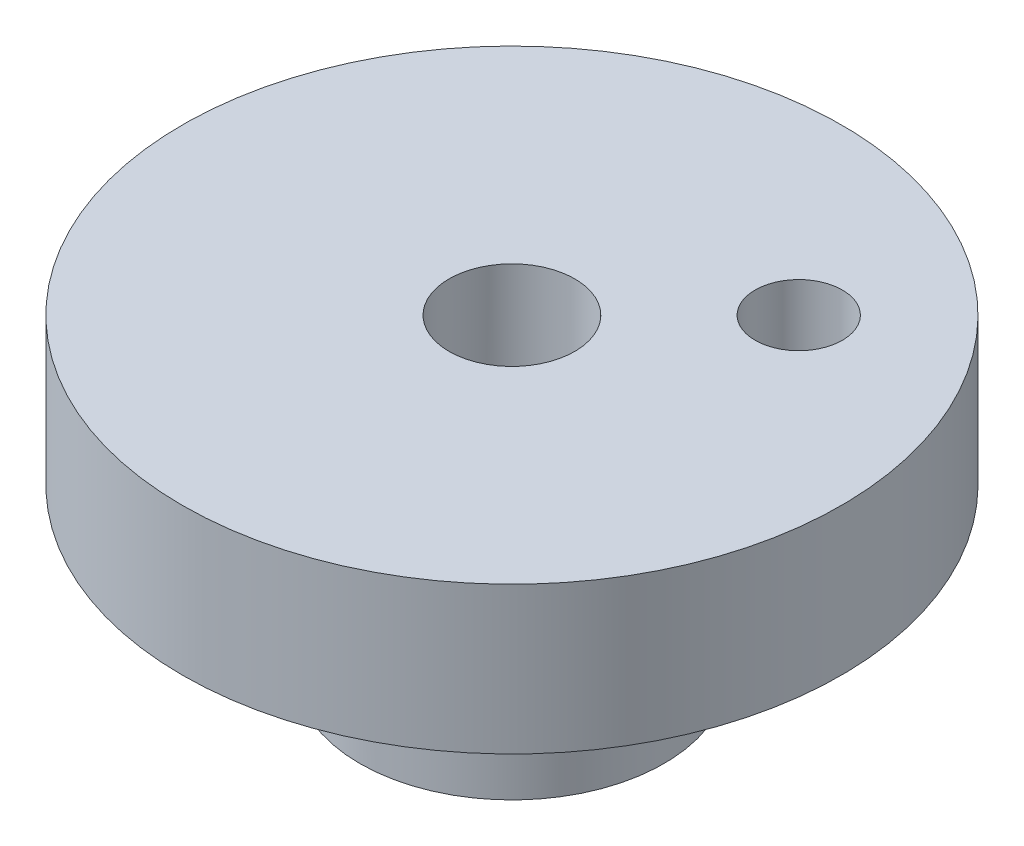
from build123d import *

# Parameters (mm, degrees)
SKETCH1_R               = 3.81
EXTRUDE1_DEPTH          = 4.1402
SKETCH2_R               = 8.255
EXTRUDE2_DEPTH          = 3.683
SKETCH3_R               = 2.3876
CUT_EXTRUDE1_DEPTH      = 4.064
SKETCH4_R               = 1.5748
CUT_EXTRUDE2_DEPTH      = 7.62
SKETCH5_R               = 1.0922
CUT_EXTRUDE3_DEPTH      = 7.62
CUT_EXTRUDE4_DEPTH      = 7.62
CUT_EXTRUDE4_DEPTH_BACK = 7.62
SKETCH6_R               = 1.1176
CUT_EXTRUDE5_DEPTH      = 7.62
CUT_EXTRUDE5_DEPTH_BACK = 7.62
SKETCH7_R               = 1.1176
CHAMFER1_SIZE           = 0.762


with BuildPart() as part:
    # Sketch1 → Extrude1 (new body)
    with BuildSketch(Plane(origin=(0, 0, 0), x_dir=(1, 0, 0), z_dir=(0, 1, 0))):
        with Locations(Location((0, 0, 0), (0, 0, 270))):
            Circle(SKETCH1_R)
    extrude(amount=EXTRUDE1_DEPTH)

    # Sketch2 → Extrude2 (add)
    with BuildSketch(Plane(origin=(0, 4.1402, 0), x_dir=(-1, 0, 0), z_dir=(0, 1, 0))):
        with Locations(Location((0, 0, 0), (0, 0, 90))):
            Circle(SKETCH2_R)
    extrude(amount=EXTRUDE2_DEPTH)

    # Sketch3 → Cut-Extrude1 (cut)
    with BuildSketch(Plane.XZ):
        with Locations(Location((0, 0, 0), (0, 0, 270))):
            Circle(SKETCH3_R)
    extrude(amount=-CUT_EXTRUDE1_DEPTH, mode=Mode.SUBTRACT)

    # Sketch4 → Cut-Extrude2 (cut)
    with BuildSketch(Plane(origin=(0, 7.8232, 0), x_dir=(-1, 0, 0), z_dir=(0, 1, 0))):
        with Locations(Location((0, 0, 0), (0, 0, 90))):
            Circle(SKETCH4_R)
    extrude(amount=-CUT_EXTRUDE2_DEPTH, mode=Mode.SUBTRACT)

    # Sketch5 → Cut-Extrude3 (cut)
    with BuildSketch(Plane(origin=(0, 7.8232, 0), x_dir=(-1, 0, 0), z_dir=(0, 1, 0))):
        with Locations(Location((-3.592102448, -3.592102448, 0), (0, 0, 90))):
            Circle(SKETCH5_R)
    extrude(amount=-CUT_EXTRUDE3_DEPTH, mode=Mode.SUBTRACT)

    # Sketch6 → Cut-Extrude4 (cut, two sides: drawn at the far end of the back side and taken through both)
    with BuildSketch(Plane.XY.offset(-CUT_EXTRUDE4_DEPTH_BACK)):
        with Locations((0, 2.032)):
            Circle(SKETCH6_R)
    extrude(amount=CUT_EXTRUDE4_DEPTH + CUT_EXTRUDE4_DEPTH_BACK, mode=Mode.SUBTRACT)

    # Sketch7 → Cut-Extrude5 (cut, two sides: drawn at the far end of the back side and taken through both)
    with BuildSketch(Plane(origin=(0, 0, 0), x_dir=(0, 0, -1), z_dir=(1, 0, 0)).offset(-CUT_EXTRUDE5_DEPTH_BACK)):
        with Locations((0, 2.032)):
            Circle(SKETCH7_R)
    extrude(amount=CUT_EXTRUDE5_DEPTH + CUT_EXTRUDE5_DEPTH_BACK, mode=Mode.SUBTRACT)

    # Chamfer1
    chamfer1_edges = [part.edges().sort_by_distance(p)[0] for p in [
        (0, 4.064, -1.5748),
    ]]
    chamfer(chamfer1_edges, length=CHAMFER1_SIZE)


solid = part.part
